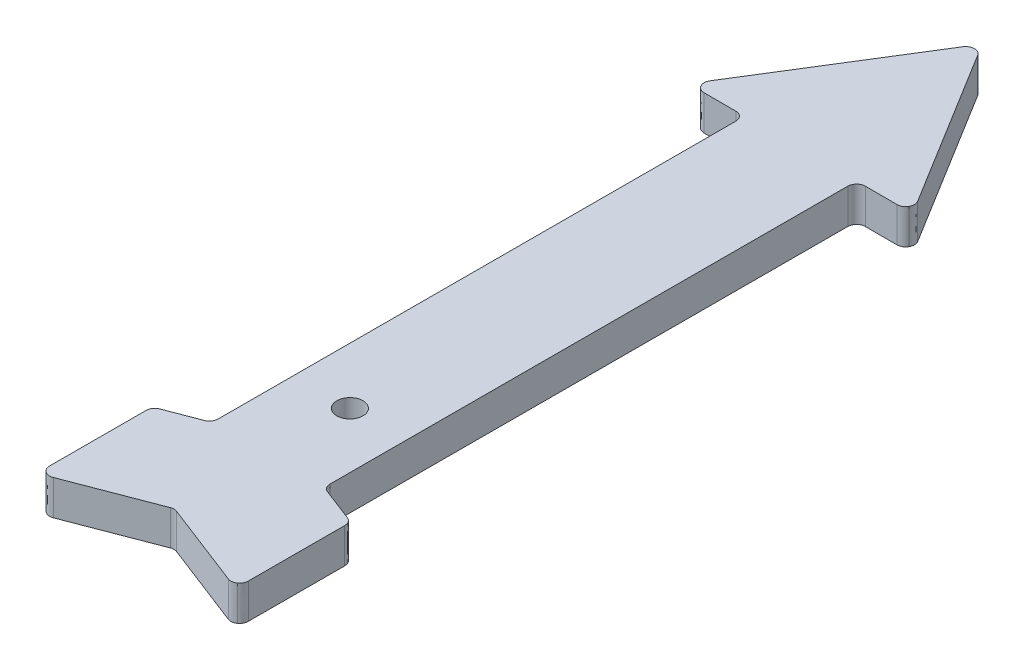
ISO-10303-21;
HEADER;
FILE_DESCRIPTION(('STEP AP214'),'2;1');
FILE_NAME('part.step','',(''),(''),'','','');
FILE_SCHEMA(('AUTOMOTIVE_DESIGN { 1 0 10303 214 1 1 1 1 }'));
ENDSEC;
DATA;
#1=APPLICATION_CONTEXT('core data for automotive mechanical design processes');
#2=APPLICATION_PROTOCOL_DEFINITION('international standard','automotive_design',2000,#1);
#3=PRODUCT_CONTEXT('',#1,'mechanical');
#4=PRODUCT('Part','Part','',(#3));
#5=PRODUCT_RELATED_PRODUCT_CATEGORY('part','',(#4));
#6=PRODUCT_DEFINITION_FORMATION('','',#4);
#7=PRODUCT_DEFINITION_CONTEXT('part definition',#1,'design');
#8=PRODUCT_DEFINITION('design','',#6,#7);
#9=PRODUCT_DEFINITION_SHAPE('','',#8);
#10=(LENGTH_UNIT() NAMED_UNIT(*) SI_UNIT(.MILLI.,.METRE.));
#11=(NAMED_UNIT(*) PLANE_ANGLE_UNIT() SI_UNIT($,.RADIAN.));
#12=(NAMED_UNIT(*) SI_UNIT($,.STERADIAN.) SOLID_ANGLE_UNIT());
#13=UNCERTAINTY_MEASURE_WITH_UNIT(LENGTH_MEASURE(1.E-05),#10,'distance_accuracy_value','');
#14=(GEOMETRIC_REPRESENTATION_CONTEXT(3) GLOBAL_UNCERTAINTY_ASSIGNED_CONTEXT((#13)) GLOBAL_UNIT_ASSIGNED_CONTEXT((#10,
#11,#12)) REPRESENTATION_CONTEXT('',''));
#15=CARTESIAN_POINT('',(0.,0.,0.));
#16=DIRECTION('',(0.,0.,1.));
#17=DIRECTION('',(1.,0.,0.));
#18=AXIS2_PLACEMENT_3D('',#15,#16,#17);
#19=CARTESIAN_POINT('',(6.5401625,16.,9.1937625));
#20=DIRECTION('',(0.,1.,0.));
#21=DIRECTION('',(0.,0.,1.));
#22=AXIS2_PLACEMENT_3D('',#19,#20,#21);
#23=PLANE('',#22);
#24=CARTESIAN_POINT('',(7.0074,16.,9.5598));
#25=CARTESIAN_POINT('',(6.614,16.,9.4075));
#26=CARTESIAN_POINT('',(6.3678,16.,9.0474));
#27=CARTESIAN_POINT('',(6.3685,16.,8.6256));
#28=B_SPLINE_CURVE_WITH_KNOTS('',3,(#24,#25,#26,#27),.UNSPECIFIED.,.F.,.F.,(4,4),
(0.96551724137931,1.),.UNSPECIFIED.);
#29=CARTESIAN_POINT('',(7.0074,16.,9.5598));
#30=VERTEX_POINT('',#29);
#31=CARTESIAN_POINT('',(6.3685,16.,8.6256));
#32=VERTEX_POINT('',#31);
#33=EDGE_CURVE('E753',#30,#32,#28,.T.);
#34=ORIENTED_EDGE('',*,*,#33,.T.);
#35=DIRECTION('',(0.00182271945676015,0.,-0.999998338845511));
#36=VECTOR('',#35,1.);
#37=CARTESIAN_POINT('',(6.3685,16.,8.6256));
#38=LINE('',#37,#36);
#39=CARTESIAN_POINT('',(6.4763,16.,-50.5167));
#40=VERTEX_POINT('',#39);
#41=EDGE_CURVE('E163',#32,#40,#38,.T.);
#42=ORIENTED_EDGE('',*,*,#41,.T.);
#43=CARTESIAN_POINT('',(6.4763,16.,-50.5167));
#44=CARTESIAN_POINT('',(6.4773,16.,-51.0675));
#45=CARTESIAN_POINT('',(6.9273,16.,-51.5159));
#46=CARTESIAN_POINT('',(7.4781,16.,-51.5149));
#47=B_SPLINE_CURVE_WITH_KNOTS('',3,(#43,#44,#45,#46),.UNSPECIFIED.,.F.,.F.,(4,4),
(0.0344827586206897,0.0689655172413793),.UNSPECIFIED.);
#48=CARTESIAN_POINT('',(7.4781,16.,-51.5149));
#49=VERTEX_POINT('',#48);
#50=EDGE_CURVE('E626',#40,#49,#47,.T.);
#51=ORIENTED_EDGE('',*,*,#50,.T.);
#52=DIRECTION('',(0.999998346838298,0.,0.00181832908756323));
#53=VECTOR('',#52,1.);
#54=CARTESIAN_POINT('',(7.4781,16.,-51.5149));
#55=LINE('',#54,#53);
#56=CARTESIAN_POINT('',(11.1078,16.,-51.5083));
#57=VERTEX_POINT('',#56);
#58=EDGE_CURVE('E781',#49,#57,#55,.T.);
#59=ORIENTED_EDGE('',*,*,#58,.T.);
#60=CARTESIAN_POINT('',(11.1078,16.,-51.5083));
#61=CARTESIAN_POINT('',(11.4804,16.,-51.5076));
#62=CARTESIAN_POINT('',(11.8005,16.,-51.6948));
#63=CARTESIAN_POINT('',(11.9823,16.,-52.02));
#64=B_SPLINE_CURVE_WITH_KNOTS('',3,(#60,#61,#62,#63),.UNSPECIFIED.,.F.,.F.,(4,4),
(0.103448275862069,0.137931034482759),.UNSPECIFIED.);
#65=CARTESIAN_POINT('',(11.9823,16.,-52.02));
#66=VERTEX_POINT('',#65);
#67=EDGE_CURVE('E462',#57,#66,#64,.T.);
#68=ORIENTED_EDGE('',*,*,#67,.T.);
#69=CARTESIAN_POINT('',(11.9823,16.,-52.02));
#70=CARTESIAN_POINT('',(12.1642,16.,-52.3451));
#71=CARTESIAN_POINT('',(12.1563,16.,-52.7158));
#72=CARTESIAN_POINT('',(11.9609,16.,-53.033));
#73=B_SPLINE_CURVE_WITH_KNOTS('',3,(#69,#70,#71,#72),.UNSPECIFIED.,.F.,.F.,(4,4),
(0.137931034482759,0.172413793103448),.UNSPECIFIED.);
#74=CARTESIAN_POINT('',(11.9609,16.,-53.033));
#75=VERTEX_POINT('',#74);
#76=EDGE_CURVE('E457',#66,#75,#73,.T.);
#77=ORIENTED_EDGE('',*,*,#76,.T.);
#78=DIRECTION('',(-0.52476613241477,0.,-0.851246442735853));
#79=VECTOR('',#78,1.);
#80=CARTESIAN_POINT('',(11.9609,16.,-53.033));
#81=LINE('',#80,#79);
#82=CARTESIAN_POINT('',(0.9387,16.,-70.9126));
#83=VERTEX_POINT('',#82);
#84=EDGE_CURVE('E461',#75,#83,#81,.T.);
#85=ORIENTED_EDGE('',*,*,#84,.T.);
#86=CARTESIAN_POINT('',(0.9387,16.,-70.9126));
#87=CARTESIAN_POINT('',(0.7517,16.,-71.2161));
#88=CARTESIAN_POINT('',(0.4457,16.,-71.3872));
#89=CARTESIAN_POINT('',(0.0893,16.,-71.3879));
#90=B_SPLINE_CURVE_WITH_KNOTS('',3,(#86,#87,#88,#89),.UNSPECIFIED.,.F.,.F.,(4,4),
(0.206896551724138,0.241379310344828),.UNSPECIFIED.);
#91=CARTESIAN_POINT('',(0.0893,16.,-71.3879));
#92=VERTEX_POINT('',#91);
#93=EDGE_CURVE('E427',#83,#92,#90,.T.);
#94=ORIENTED_EDGE('',*,*,#93,.T.);
#95=CARTESIAN_POINT('',(0.0893,16.,-71.3879));
#96=CARTESIAN_POINT('',(-0.2671,16.,-71.3885));
#97=CARTESIAN_POINT('',(-0.5738,16.,-71.2184));
#98=CARTESIAN_POINT('',(-0.7619,16.,-70.9157));
#99=B_SPLINE_CURVE_WITH_KNOTS('',3,(#95,#96,#97,#98),.UNSPECIFIED.,.F.,.F.,(4,4),
(0.241379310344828,0.275862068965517),.UNSPECIFIED.);
#100=CARTESIAN_POINT('',(-0.7619,16.,-70.9157));
#101=VERTEX_POINT('',#100);
#102=EDGE_CURVE('E422',#92,#101,#99,.T.);
#103=ORIENTED_EDGE('',*,*,#102,.T.);
#104=DIRECTION('',(-0.52785875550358,0.,0.849332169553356));
#105=VECTOR('',#104,1.);
#106=CARTESIAN_POINT('',(-0.7619,16.,-70.9157));
#107=LINE('',#106,#105);
#108=CARTESIAN_POINT('',(-11.849,16.,-53.0764));
#109=VERTEX_POINT('',#108);
#110=EDGE_CURVE('E417',#101,#109,#107,.T.);
#111=ORIENTED_EDGE('',*,*,#110,.T.);
#112=CARTESIAN_POINT('',(-11.849,16.,-53.0764));
#113=CARTESIAN_POINT('',(-12.0456,16.,-52.76));
#114=CARTESIAN_POINT('',(-12.0548,16.,-52.3892));
#115=CARTESIAN_POINT('',(-11.8741,16.,-52.0635));
#116=B_SPLINE_CURVE_WITH_KNOTS('',3,(#112,#113,#114,#115),.UNSPECIFIED.,.F.,.F.,(4,4),
(0.310344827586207,0.344827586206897),.UNSPECIFIED.);
#117=CARTESIAN_POINT('',(-11.8741,16.,-52.0635));
#118=VERTEX_POINT('',#117);
#119=EDGE_CURVE('E409',#109,#118,#116,.T.);
#120=ORIENTED_EDGE('',*,*,#119,.T.);
#121=CARTESIAN_POINT('',(-11.8741,16.,-52.0635));
#122=CARTESIAN_POINT('',(-11.6934,16.,-51.7377));
#123=CARTESIAN_POINT('',(-11.3741,16.,-51.5492));
#124=CARTESIAN_POINT('',(-11.0016,16.,-51.5486));
#125=B_SPLINE_CURVE_WITH_KNOTS('',3,(#121,#122,#123,#124),.UNSPECIFIED.,.F.,.F.,(4,4),
(0.344827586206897,0.379310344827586),.UNSPECIFIED.);
#126=CARTESIAN_POINT('',(-11.0016,16.,-51.5486));
#127=VERTEX_POINT('',#126);
#128=EDGE_CURVE('E405',#118,#127,#125,.T.);
#129=ORIENTED_EDGE('',*,*,#128,.T.);
#130=DIRECTION('',(0.999998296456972,0.,0.00184582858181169));
#131=VECTOR('',#130,1.);
#132=CARTESIAN_POINT('',(-11.0016,16.,-51.5486));
#133=LINE('',#132,#131);
#134=CARTESIAN_POINT('',(-7.3718,16.,-51.5419));
#135=VERTEX_POINT('',#134);
#136=EDGE_CURVE('E385',#127,#135,#133,.T.);
#137=ORIENTED_EDGE('',*,*,#136,.T.);
#138=CARTESIAN_POINT('',(-7.3718,16.,-51.5419));
#139=CARTESIAN_POINT('',(-6.821,16.,-51.5409));
#140=CARTESIAN_POINT('',(-6.3726,16.,-51.0908));
#141=CARTESIAN_POINT('',(-6.3736,16.,-50.5401));
#142=B_SPLINE_CURVE_WITH_KNOTS('',3,(#138,#139,#140,#141),.UNSPECIFIED.,.F.,.F.,(4,4),
(0.413793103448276,0.448275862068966),.UNSPECIFIED.);
#143=CARTESIAN_POINT('',(-6.3736,16.,-50.5401));
#144=VERTEX_POINT('',#143);
#145=EDGE_CURVE('E380',#135,#144,#142,.T.);
#146=ORIENTED_EDGE('',*,*,#145,.T.);
#147=DIRECTION('',(-0.00182272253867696,0.,0.999998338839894));
#148=VECTOR('',#147,1.);
#149=CARTESIAN_POINT('',(-6.3736,16.,-50.5401));
#150=LINE('',#149,#148);
#151=CARTESIAN_POINT('',(-6.4814,16.,8.6021));
#152=VERTEX_POINT('',#151);
#153=EDGE_CURVE('E375',#144,#152,#150,.T.);
#154=ORIENTED_EDGE('',*,*,#153,.T.);
#155=CARTESIAN_POINT('',(-6.4814,16.,8.6021));
#156=CARTESIAN_POINT('',(-6.4822,16.,9.0239));
#157=CARTESIAN_POINT('',(-6.7297,16.,9.3832));
#158=CARTESIAN_POINT('',(-7.1237,16.,9.5341));
#159=B_SPLINE_CURVE_WITH_KNOTS('',3,(#155,#156,#157,#158),.UNSPECIFIED.,.F.,.F.,(4,4),
(0.482758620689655,0.517241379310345),.UNSPECIFIED.);
#160=CARTESIAN_POINT('',(-7.1237,16.,9.5341));
#161=VERTEX_POINT('',#160);
#162=EDGE_CURVE('E370',#152,#161,#159,.T.);
#163=ORIENTED_EDGE('',*,*,#162,.T.);
#164=DIRECTION('',(-0.933822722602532,0.,0.35773610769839));
#165=VECTOR('',#164,1.);
#166=CARTESIAN_POINT('',(-7.1237,16.,9.5341));
#167=LINE('',#166,#165);
#168=CARTESIAN_POINT('',(-10.8098,16.,10.9462));
#169=VERTEX_POINT('',#168);
#170=EDGE_CURVE('E349',#161,#169,#167,.T.);
#171=ORIENTED_EDGE('',*,*,#170,.T.);
#172=CARTESIAN_POINT('',(-10.8098,16.,10.9462));
#173=CARTESIAN_POINT('',(-11.2038,16.,11.0971));
#174=CARTESIAN_POINT('',(-11.4514,16.,11.4563));
#175=CARTESIAN_POINT('',(-11.4521,16.,11.8782));
#176=B_SPLINE_CURVE_WITH_KNOTS('',3,(#172,#173,#174,#175),.UNSPECIFIED.,.F.,.F.,(4,4),
(0.551724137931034,0.586206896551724),.UNSPECIFIED.);
#177=CARTESIAN_POINT('',(-11.4521,16.,11.8782));
#178=VERTEX_POINT('',#177);
#179=EDGE_CURVE('E344',#169,#178,#176,.T.);
#180=ORIENTED_EDGE('',*,*,#179,.T.);
#181=DIRECTION('',(-0.00182445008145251,0.,0.999998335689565));
#182=VECTOR('',#181,1.);
#183=CARTESIAN_POINT('',(-11.4521,16.,11.8782));
#184=LINE('',#183,#182);
#185=CARTESIAN_POINT('',(-11.4722,16.,22.8952));
#186=VERTEX_POINT('',#185);
#187=EDGE_CURVE('E339',#178,#186,#184,.T.);
#188=ORIENTED_EDGE('',*,*,#187,.T.);
#189=CARTESIAN_POINT('',(-11.4722,16.,22.8952));
#190=CARTESIAN_POINT('',(-11.4728,16.,23.235));
#191=CARTESIAN_POINT('',(-11.3195,16.,23.5276));
#192=CARTESIAN_POINT('',(-11.0397,16.,23.7205));
#193=B_SPLINE_CURVE_WITH_KNOTS('',3,(#189,#190,#191,#192),.UNSPECIFIED.,.F.,.F.,(4,4),
(0.620689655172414,0.655172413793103),.UNSPECIFIED.);
#194=CARTESIAN_POINT('',(-11.0397,16.,23.7205));
#195=VERTEX_POINT('',#194);
#196=EDGE_CURVE('E331',#186,#195,#193,.T.);
#197=ORIENTED_EDGE('',*,*,#196,.T.);
#198=CARTESIAN_POINT('',(-11.0397,16.,23.7205));
#199=CARTESIAN_POINT('',(-10.7598,16.,23.9133));
#200=CARTESIAN_POINT('',(-10.4318,16.,23.9524));
#201=CARTESIAN_POINT('',(-10.1145,16.,23.8309));
#202=B_SPLINE_CURVE_WITH_KNOTS('',3,(#198,#199,#200,#201),.UNSPECIFIED.,.F.,.F.,(4,4),
(0.655172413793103,0.689655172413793),.UNSPECIFIED.);
#203=CARTESIAN_POINT('',(-10.1145,16.,23.8309));
#204=VERTEX_POINT('',#203);
#205=EDGE_CURVE('E327',#195,#204,#202,.T.);
#206=ORIENTED_EDGE('',*,*,#205,.T.);
#207=DIRECTION('',(0.933828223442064,0.,-0.357721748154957));
#208=VECTOR('',#207,1.);
#209=CARTESIAN_POINT('',(-10.1145,16.,23.8309));
#210=LINE('',#209,#208);
#211=CARTESIAN_POINT('',(-0.4369,16.,20.1237));
#212=VERTEX_POINT('',#211);
#213=EDGE_CURVE('E305',#204,#212,#210,.T.);
#214=ORIENTED_EDGE('',*,*,#213,.T.);
#215=CARTESIAN_POINT('',(-0.4369,16.,20.1237));
#216=CARTESIAN_POINT('',(-0.1961,16.,20.0315));
#217=CARTESIAN_POINT('',(0.0415,16.,20.0319));
#218=CARTESIAN_POINT('',(0.2819,16.,20.125));
#219=B_SPLINE_CURVE_WITH_KNOTS('',3,(#215,#216,#217,#218),.UNSPECIFIED.,.F.,.F.,(4,4),
(0.724137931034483,0.758620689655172),.UNSPECIFIED.);
#220=CARTESIAN_POINT('',(0.2819,16.,20.125));
#221=VERTEX_POINT('',#220);
#222=EDGE_CURVE('E300',#212,#221,#219,.T.);
#223=ORIENTED_EDGE('',*,*,#222,.T.);
#224=DIRECTION('',(0.932520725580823,0.,0.361116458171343));
#225=VECTOR('',#224,1.);
#226=CARTESIAN_POINT('',(0.2819,16.,20.125));
#227=LINE('',#226,#225);
#228=CARTESIAN_POINT('',(9.946,16.,23.8674));
#229=VERTEX_POINT('',#228);
#230=EDGE_CURVE('E295',#221,#229,#227,.T.);
#231=ORIENTED_EDGE('',*,*,#230,.T.);
#232=CARTESIAN_POINT('',(9.946,16.,23.8674));
#233=CARTESIAN_POINT('',(10.2629,16.,23.9901));
#234=CARTESIAN_POINT('',(10.5911,16.,23.9522));
#235=CARTESIAN_POINT('',(10.8716,16.,23.7604));
#236=B_SPLINE_CURVE_WITH_KNOTS('',3,(#232,#233,#234,#235),.UNSPECIFIED.,.F.,.F.,(4,4),
(0.793103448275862,0.827586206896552),.UNSPECIFIED.);
#237=CARTESIAN_POINT('',(10.8716,16.,23.7604));
#238=VERTEX_POINT('',#237);
#239=EDGE_CURVE('E287',#229,#238,#236,.T.);
#240=ORIENTED_EDGE('',*,*,#239,.T.);
#241=CARTESIAN_POINT('',(10.8716,16.,23.7604));
#242=CARTESIAN_POINT('',(11.1521,16.,23.5685));
#243=CARTESIAN_POINT('',(11.3065,16.,23.2765));
#244=CARTESIAN_POINT('',(11.3071,16.,22.9367));
#245=B_SPLINE_CURVE_WITH_KNOTS('',3,(#241,#242,#243,#244),.UNSPECIFIED.,.F.,.F.,(4,4),
(0.827586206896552,0.862068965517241),.UNSPECIFIED.);
#246=CARTESIAN_POINT('',(11.3071,16.,22.9367));
#247=VERTEX_POINT('',#246);
#248=EDGE_CURVE('E245',#238,#247,#245,.T.);
#249=ORIENTED_EDGE('',*,*,#248,.T.);
#250=DIRECTION('',(0.0018244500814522,0.,-0.999998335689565));
#251=VECTOR('',#250,1.);
#252=CARTESIAN_POINT('',(11.3071,16.,22.9367));
#253=LINE('',#252,#251);
#254=CARTESIAN_POINT('',(11.3272,16.,11.9197));
#255=VERTEX_POINT('',#254);
#256=EDGE_CURVE('E239',#247,#255,#253,.T.);
#257=ORIENTED_EDGE('',*,*,#256,.T.);
#258=CARTESIAN_POINT('',(11.3272,16.,11.9197));
#259=CARTESIAN_POINT('',(11.328,16.,11.4979));
#260=CARTESIAN_POINT('',(11.0818,16.,11.1377));
#261=CARTESIAN_POINT('',(10.6883,16.,10.9854));
#262=B_SPLINE_CURVE_WITH_KNOTS('',3,(#258,#259,#260,#261),.UNSPECIFIED.,.F.,.F.,(4,4),
(0.896551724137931,0.931034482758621),.UNSPECIFIED.);
#263=CARTESIAN_POINT('',(10.6883,16.,10.9854));
#264=VERTEX_POINT('',#263);
#265=EDGE_CURVE('E243',#255,#264,#262,.T.);
#266=ORIENTED_EDGE('',*,*,#265,.T.);
#267=DIRECTION('',(-0.932505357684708,0.,-0.361156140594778));
#268=VECTOR('',#267,1.);
#269=CARTESIAN_POINT('',(10.6883,16.,10.9854));
#270=LINE('',#269,#268);
#271=EDGE_CURVE('E57',#264,#30,#270,.T.);
#272=ORIENTED_EDGE('',*,*,#271,.T.);
#273=EDGE_LOOP('',(#34,#42,#51,#59,#68,#77,#85,#94,#103,#111,#120,#129,#137,#146,#154,#163,#171,
#180,#188,#197,#206,#214,#223,#231,#240,#249,#257,#266,#272));
#274=FACE_BOUND('',#273,.T.);
#275=CARTESIAN_POINT('',(0.,16.,0.));
#276=DIRECTION('',(0.,1.,0.));
#277=DIRECTION('',(0.,0.,1.));
#278=AXIS2_PLACEMENT_3D('',#275,#276,#277);
#279=CIRCLE('',#278,1.5);
#280=CARTESIAN_POINT('',(0.,16.,1.5));
#281=VERTEX_POINT('',#280);
#282=EDGE_CURVE('E757',#281,#281,#279,.T.);
#283=ORIENTED_EDGE('',*,*,#282,.F.);
#284=EDGE_LOOP('',(#283));
#285=FACE_BOUND('',#284,.T.);
#286=ADVANCED_FACE('F39',(#274,#285),#23,.T.);
#287=CARTESIAN_POINT('',(6.5401625,12.,9.1937625));
#288=DIRECTION('',(0.,1.,0.));
#289=DIRECTION('',(0.,0.,1.));
#290=AXIS2_PLACEMENT_3D('',#287,#288,#289);
#291=PLANE('',#290);
#292=CARTESIAN_POINT('',(7.0074,12.,9.5598));
#293=CARTESIAN_POINT('',(6.614,12.,9.4075));
#294=CARTESIAN_POINT('',(6.3678,12.,9.0474));
#295=CARTESIAN_POINT('',(6.3685,12.,8.6256));
#296=B_SPLINE_CURVE_WITH_KNOTS('',3,(#292,#293,#294,#295),.UNSPECIFIED.,.F.,.F.,(4,4),
(0.96551724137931,1.),.UNSPECIFIED.);
#297=CARTESIAN_POINT('',(7.0074,12.,9.5598));
#298=VERTEX_POINT('',#297);
#299=CARTESIAN_POINT('',(6.3685,12.,8.6256));
#300=VERTEX_POINT('',#299);
#301=EDGE_CURVE('E638',#298,#300,#296,.T.);
#302=ORIENTED_EDGE('',*,*,#301,.F.);
#303=DIRECTION('',(-0.932505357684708,0.,-0.361156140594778));
#304=VECTOR('',#303,1.);
#305=CARTESIAN_POINT('',(10.6883,12.,10.9854));
#306=LINE('',#305,#304);
#307=CARTESIAN_POINT('',(10.6883,12.,10.9854));
#308=VERTEX_POINT('',#307);
#309=EDGE_CURVE('E155',#308,#298,#306,.T.);
#310=ORIENTED_EDGE('',*,*,#309,.F.);
#311=CARTESIAN_POINT('',(11.3272,12.,11.9197));
#312=CARTESIAN_POINT('',(11.328,12.,11.4979));
#313=CARTESIAN_POINT('',(11.0818,12.,11.1377));
#314=CARTESIAN_POINT('',(10.6883,12.,10.9854));
#315=B_SPLINE_CURVE_WITH_KNOTS('',3,(#311,#312,#313,#314),.UNSPECIFIED.,.F.,.F.,(4,4),
(0.896551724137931,0.931034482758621),.UNSPECIFIED.);
#316=CARTESIAN_POINT('',(11.3272,12.,11.9197));
#317=VERTEX_POINT('',#316);
#318=EDGE_CURVE('E149',#317,#308,#315,.T.);
#319=ORIENTED_EDGE('',*,*,#318,.F.);
#320=DIRECTION('',(0.0018244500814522,0.,-0.999998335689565));
#321=VECTOR('',#320,1.);
#322=CARTESIAN_POINT('',(11.3071,12.,22.9367));
#323=LINE('',#322,#321);
#324=CARTESIAN_POINT('',(11.3071,12.,22.9367));
#325=VERTEX_POINT('',#324);
#326=EDGE_CURVE('E253',#325,#317,#323,.T.);
#327=ORIENTED_EDGE('',*,*,#326,.F.);
#328=CARTESIAN_POINT('',(10.8716,12.,23.7604));
#329=CARTESIAN_POINT('',(11.1521,12.,23.5685));
#330=CARTESIAN_POINT('',(11.3065,12.,23.2765));
#331=CARTESIAN_POINT('',(11.3071,12.,22.9367));
#332=B_SPLINE_CURVE_WITH_KNOTS('',3,(#328,#329,#330,#331),.UNSPECIFIED.,.F.,.F.,(4,4),
(0.827586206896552,0.862068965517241),.UNSPECIFIED.);
#333=CARTESIAN_POINT('',(10.8716,12.,23.7604));
#334=VERTEX_POINT('',#333);
#335=EDGE_CURVE('E598',#334,#325,#332,.T.);
#336=ORIENTED_EDGE('',*,*,#335,.F.);
#337=CARTESIAN_POINT('',(9.946,12.,23.8674));
#338=CARTESIAN_POINT('',(10.2629,12.,23.9901));
#339=CARTESIAN_POINT('',(10.5911,12.,23.9522));
#340=CARTESIAN_POINT('',(10.8716,12.,23.7604));
#341=B_SPLINE_CURVE_WITH_KNOTS('',3,(#337,#338,#339,#340),.UNSPECIFIED.,.F.,.F.,(4,4),
(0.793103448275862,0.827586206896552),.UNSPECIFIED.);
#342=CARTESIAN_POINT('',(9.946,12.,23.8674));
#343=VERTEX_POINT('',#342);
#344=EDGE_CURVE('E595',#343,#334,#341,.T.);
#345=ORIENTED_EDGE('',*,*,#344,.F.);
#346=DIRECTION('',(0.932520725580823,0.,0.361116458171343));
#347=VECTOR('',#346,1.);
#348=CARTESIAN_POINT('',(0.2819,12.,20.125));
#349=LINE('',#348,#347);
#350=CARTESIAN_POINT('',(0.2819,12.,20.125));
#351=VERTEX_POINT('',#350);
#352=EDGE_CURVE('E588',#351,#343,#349,.T.);
#353=ORIENTED_EDGE('',*,*,#352,.F.);
#354=CARTESIAN_POINT('',(-0.4369,12.,20.1237));
#355=CARTESIAN_POINT('',(-0.1961,12.,20.0315));
#356=CARTESIAN_POINT('',(0.0415,12.,20.0319));
#357=CARTESIAN_POINT('',(0.2819,12.,20.125));
#358=B_SPLINE_CURVE_WITH_KNOTS('',3,(#354,#355,#356,#357),.UNSPECIFIED.,.F.,.F.,(4,4),
(0.724137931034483,0.758620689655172),.UNSPECIFIED.);
#359=CARTESIAN_POINT('',(-0.4369,12.,20.1237));
#360=VERTEX_POINT('',#359);
#361=EDGE_CURVE('E581',#360,#351,#358,.T.);
#362=ORIENTED_EDGE('',*,*,#361,.F.);
#363=DIRECTION('',(0.933828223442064,0.,-0.357721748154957));
#364=VECTOR('',#363,1.);
#365=CARTESIAN_POINT('',(-10.1145,12.,23.8309));
#366=LINE('',#365,#364);
#367=CARTESIAN_POINT('',(-10.1145,12.,23.8309));
#368=VERTEX_POINT('',#367);
#369=EDGE_CURVE('E721',#368,#360,#366,.T.);
#370=ORIENTED_EDGE('',*,*,#369,.F.);
#371=CARTESIAN_POINT('',(-11.0397,12.,23.7205));
#372=CARTESIAN_POINT('',(-10.7598,12.,23.9133));
#373=CARTESIAN_POINT('',(-10.4318,12.,23.9524));
#374=CARTESIAN_POINT('',(-10.1145,12.,23.8309));
#375=B_SPLINE_CURVE_WITH_KNOTS('',3,(#371,#372,#373,#374),.UNSPECIFIED.,.F.,.F.,(4,4),
(0.655172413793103,0.689655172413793),.UNSPECIFIED.);
#376=CARTESIAN_POINT('',(-11.0397,12.,23.7205));
#377=VERTEX_POINT('',#376);
#378=EDGE_CURVE('E568',#377,#368,#375,.T.);
#379=ORIENTED_EDGE('',*,*,#378,.F.);
#380=CARTESIAN_POINT('',(-11.4722,12.,22.8952));
#381=CARTESIAN_POINT('',(-11.4728,12.,23.235));
#382=CARTESIAN_POINT('',(-11.3195,12.,23.5276));
#383=CARTESIAN_POINT('',(-11.0397,12.,23.7205));
#384=B_SPLINE_CURVE_WITH_KNOTS('',3,(#380,#381,#382,#383),.UNSPECIFIED.,.F.,.F.,(4,4),
(0.620689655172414,0.655172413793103),.UNSPECIFIED.);
#385=CARTESIAN_POINT('',(-11.4722,12.,22.8952));
#386=VERTEX_POINT('',#385);
#387=EDGE_CURVE('E562',#386,#377,#384,.T.);
#388=ORIENTED_EDGE('',*,*,#387,.F.);
#389=DIRECTION('',(-0.00182445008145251,0.,0.999998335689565));
#390=VECTOR('',#389,1.);
#391=CARTESIAN_POINT('',(-11.4521,12.,11.8782));
#392=LINE('',#391,#390);
#393=CARTESIAN_POINT('',(-11.4521,12.,11.8782));
#394=VERTEX_POINT('',#393);
#395=EDGE_CURVE('E707',#394,#386,#392,.T.);
#396=ORIENTED_EDGE('',*,*,#395,.F.);
#397=CARTESIAN_POINT('',(-10.8098,12.,10.9462));
#398=CARTESIAN_POINT('',(-11.2038,12.,11.0971));
#399=CARTESIAN_POINT('',(-11.4514,12.,11.4563));
#400=CARTESIAN_POINT('',(-11.4521,12.,11.8782));
#401=B_SPLINE_CURVE_WITH_KNOTS('',3,(#397,#398,#399,#400),.UNSPECIFIED.,.F.,.F.,(4,4),
(0.551724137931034,0.586206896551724),.UNSPECIFIED.);
#402=CARTESIAN_POINT('',(-10.8098,12.,10.9462));
#403=VERTEX_POINT('',#402);
#404=EDGE_CURVE('E547',#403,#394,#401,.T.);
#405=ORIENTED_EDGE('',*,*,#404,.F.);
#406=DIRECTION('',(-0.933822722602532,0.,0.35773610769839));
#407=VECTOR('',#406,1.);
#408=CARTESIAN_POINT('',(-7.1237,12.,9.5341));
#409=LINE('',#408,#407);
#410=CARTESIAN_POINT('',(-7.1237,12.,9.5341));
#411=VERTEX_POINT('',#410);
#412=EDGE_CURVE('E541',#411,#403,#409,.T.);
#413=ORIENTED_EDGE('',*,*,#412,.F.);
#414=CARTESIAN_POINT('',(-6.4814,12.,8.6021));
#415=CARTESIAN_POINT('',(-6.4822,12.,9.0239));
#416=CARTESIAN_POINT('',(-6.7297,12.,9.3832));
#417=CARTESIAN_POINT('',(-7.1237,12.,9.5341));
#418=B_SPLINE_CURVE_WITH_KNOTS('',3,(#414,#415,#416,#417),.UNSPECIFIED.,.F.,.F.,(4,4),
(0.482758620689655,0.517241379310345),.UNSPECIFIED.);
#419=CARTESIAN_POINT('',(-6.4814,12.,8.6021));
#420=VERTEX_POINT('',#419);
#421=EDGE_CURVE('E696',#420,#411,#418,.T.);
#422=ORIENTED_EDGE('',*,*,#421,.F.);
#423=DIRECTION('',(-0.00182272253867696,0.,0.999998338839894));
#424=VECTOR('',#423,1.);
#425=CARTESIAN_POINT('',(-6.3736,12.,-50.5401));
#426=LINE('',#425,#424);
#427=CARTESIAN_POINT('',(-6.3736,12.,-50.5401));
#428=VERTEX_POINT('',#427);
#429=EDGE_CURVE('E528',#428,#420,#426,.T.);
#430=ORIENTED_EDGE('',*,*,#429,.F.);
#431=CARTESIAN_POINT('',(-7.3718,12.,-51.5419));
#432=CARTESIAN_POINT('',(-6.821,12.,-51.5409));
#433=CARTESIAN_POINT('',(-6.3726,12.,-51.0908));
#434=CARTESIAN_POINT('',(-6.3736,12.,-50.5401));
#435=B_SPLINE_CURVE_WITH_KNOTS('',3,(#431,#432,#433,#434),.UNSPECIFIED.,.F.,.F.,(4,4),
(0.413793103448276,0.448275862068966),.UNSPECIFIED.);
#436=CARTESIAN_POINT('',(-7.3718,12.,-51.5419));
#437=VERTEX_POINT('',#436);
#438=EDGE_CURVE('E521',#437,#428,#435,.T.);
#439=ORIENTED_EDGE('',*,*,#438,.F.);
#440=DIRECTION('',(0.999998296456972,0.,0.00184582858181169));
#441=VECTOR('',#440,1.);
#442=CARTESIAN_POINT('',(-11.0016,12.,-51.5486));
#443=LINE('',#442,#441);
#444=CARTESIAN_POINT('',(-11.0016,12.,-51.5486));
#445=VERTEX_POINT('',#444);
#446=EDGE_CURVE('E684',#445,#437,#443,.T.);
#447=ORIENTED_EDGE('',*,*,#446,.F.);
#448=CARTESIAN_POINT('',(-11.8741,12.,-52.0635));
#449=CARTESIAN_POINT('',(-11.6934,12.,-51.7377));
#450=CARTESIAN_POINT('',(-11.3741,12.,-51.5492));
#451=CARTESIAN_POINT('',(-11.0016,12.,-51.5486));
#452=B_SPLINE_CURVE_WITH_KNOTS('',3,(#448,#449,#450,#451),.UNSPECIFIED.,.F.,.F.,(4,4),
(0.344827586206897,0.379310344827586),.UNSPECIFIED.);
#453=CARTESIAN_POINT('',(-11.8741,12.,-52.0635));
#454=VERTEX_POINT('',#453);
#455=EDGE_CURVE('E508',#454,#445,#452,.T.);
#456=ORIENTED_EDGE('',*,*,#455,.F.);
#457=CARTESIAN_POINT('',(-11.849,12.,-53.0764));
#458=CARTESIAN_POINT('',(-12.0456,12.,-52.76));
#459=CARTESIAN_POINT('',(-12.0548,12.,-52.3892));
#460=CARTESIAN_POINT('',(-11.8741,12.,-52.0635));
#461=B_SPLINE_CURVE_WITH_KNOTS('',3,(#457,#458,#459,#460),.UNSPECIFIED.,.F.,.F.,(4,4),
(0.310344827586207,0.344827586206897),.UNSPECIFIED.);
#462=CARTESIAN_POINT('',(-11.849,12.,-53.0764));
#463=VERTEX_POINT('',#462);
#464=EDGE_CURVE('E502',#463,#454,#461,.T.);
#465=ORIENTED_EDGE('',*,*,#464,.F.);
#466=DIRECTION('',(-0.52785875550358,0.,0.849332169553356));
#467=VECTOR('',#466,1.);
#468=CARTESIAN_POINT('',(-0.7619,12.,-70.9157));
#469=LINE('',#468,#467);
#470=CARTESIAN_POINT('',(-0.7619,12.,-70.9157));
#471=VERTEX_POINT('',#470);
#472=EDGE_CURVE('E670',#471,#463,#469,.T.);
#473=ORIENTED_EDGE('',*,*,#472,.F.);
#474=CARTESIAN_POINT('',(0.0893,12.,-71.3879));
#475=CARTESIAN_POINT('',(-0.2671,12.,-71.3885));
#476=CARTESIAN_POINT('',(-0.5738,12.,-71.2184));
#477=CARTESIAN_POINT('',(-0.7619,12.,-70.9157));
#478=B_SPLINE_CURVE_WITH_KNOTS('',3,(#474,#475,#476,#477),.UNSPECIFIED.,.F.,.F.,(4,4),
(0.241379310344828,0.275862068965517),.UNSPECIFIED.);
#479=CARTESIAN_POINT('',(0.0893,12.,-71.3879));
#480=VERTEX_POINT('',#479);
#481=EDGE_CURVE('E487',#480,#471,#478,.T.);
#482=ORIENTED_EDGE('',*,*,#481,.F.);
#483=CARTESIAN_POINT('',(0.9387,12.,-70.9126));
#484=CARTESIAN_POINT('',(0.7517,12.,-71.2161));
#485=CARTESIAN_POINT('',(0.4457,12.,-71.3872));
#486=CARTESIAN_POINT('',(0.0893,12.,-71.3879));
#487=B_SPLINE_CURVE_WITH_KNOTS('',3,(#483,#484,#485,#486),.UNSPECIFIED.,.F.,.F.,(4,4),
(0.206896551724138,0.241379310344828),.UNSPECIFIED.);
#488=CARTESIAN_POINT('',(0.9387,12.,-70.9126));
#489=VERTEX_POINT('',#488);
#490=EDGE_CURVE('E480',#489,#480,#487,.T.);
#491=ORIENTED_EDGE('',*,*,#490,.F.);
#492=DIRECTION('',(-0.52476613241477,0.,-0.851246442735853));
#493=VECTOR('',#492,1.);
#494=CARTESIAN_POINT('',(11.9609,12.,-53.033));
#495=LINE('',#494,#493);
#496=CARTESIAN_POINT('',(11.9609,12.,-53.033));
#497=VERTEX_POINT('',#496);
#498=EDGE_CURVE('E656',#497,#489,#495,.T.);
#499=ORIENTED_EDGE('',*,*,#498,.F.);
#500=CARTESIAN_POINT('',(11.9823,12.,-52.02));
#501=CARTESIAN_POINT('',(12.1642,12.,-52.3451));
#502=CARTESIAN_POINT('',(12.1563,12.,-52.7158));
#503=CARTESIAN_POINT('',(11.9609,12.,-53.033));
#504=B_SPLINE_CURVE_WITH_KNOTS('',3,(#500,#501,#502,#503),.UNSPECIFIED.,.F.,.F.,(4,4),
(0.137931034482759,0.172413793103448),.UNSPECIFIED.);
#505=CARTESIAN_POINT('',(11.9823,12.,-52.02));
#506=VERTEX_POINT('',#505);
#507=EDGE_CURVE('E649',#506,#497,#504,.T.);
#508=ORIENTED_EDGE('',*,*,#507,.F.);
#509=CARTESIAN_POINT('',(11.1078,12.,-51.5083));
#510=CARTESIAN_POINT('',(11.4804,12.,-51.5076));
#511=CARTESIAN_POINT('',(11.8005,12.,-51.6948));
#512=CARTESIAN_POINT('',(11.9823,12.,-52.02));
#513=B_SPLINE_CURVE_WITH_KNOTS('',3,(#509,#510,#511,#512),.UNSPECIFIED.,.F.,.F.,(4,4),
(0.103448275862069,0.137931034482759),.UNSPECIFIED.);
#514=CARTESIAN_POINT('',(11.1078,12.,-51.5083));
#515=VERTEX_POINT('',#514);
#516=EDGE_CURVE('E636',#515,#506,#513,.T.);
#517=ORIENTED_EDGE('',*,*,#516,.F.);
#518=DIRECTION('',(0.999998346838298,0.,0.00181832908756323));
#519=VECTOR('',#518,1.);
#520=CARTESIAN_POINT('',(7.4781,12.,-51.5149));
#521=LINE('',#520,#519);
#522=CARTESIAN_POINT('',(7.4781,12.,-51.5149));
#523=VERTEX_POINT('',#522);
#524=EDGE_CURVE('E634',#523,#515,#521,.T.);
#525=ORIENTED_EDGE('',*,*,#524,.F.);
#526=CARTESIAN_POINT('',(6.4763,12.,-50.5167));
#527=CARTESIAN_POINT('',(6.4773,12.,-51.0675));
#528=CARTESIAN_POINT('',(6.9273,12.,-51.5159));
#529=CARTESIAN_POINT('',(7.4781,12.,-51.5149));
#530=B_SPLINE_CURVE_WITH_KNOTS('',3,(#526,#527,#528,#529),.UNSPECIFIED.,.F.,.F.,(4,4),
(0.0344827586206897,0.0689655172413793),.UNSPECIFIED.);
#531=CARTESIAN_POINT('',(6.4763,12.,-50.5167));
#532=VERTEX_POINT('',#531);
#533=EDGE_CURVE('E625',#532,#523,#530,.T.);
#534=ORIENTED_EDGE('',*,*,#533,.F.);
#535=DIRECTION('',(0.00182271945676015,0.,-0.999998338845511));
#536=VECTOR('',#535,1.);
#537=CARTESIAN_POINT('',(6.3685,12.,8.6256));
#538=LINE('',#537,#536);
#539=EDGE_CURVE('E632',#300,#532,#538,.T.);
#540=ORIENTED_EDGE('',*,*,#539,.F.);
#541=EDGE_LOOP('',(#302,#310,#319,#327,#336,#345,#353,#362,#370,#379,#388,#396,#405,#413,#422,
#430,#439,#447,#456,#465,#473,#482,#491,#499,#508,#517,#525,#534,#540));
#542=FACE_BOUND('',#541,.T.);
#543=CARTESIAN_POINT('',(0.,12.,0.));
#544=DIRECTION('',(0.,1.,0.));
#545=DIRECTION('',(0.,0.,1.));
#546=AXIS2_PLACEMENT_3D('',#543,#544,#545);
#547=CIRCLE('',#546,1.5);
#548=CARTESIAN_POINT('',(0.,12.,1.5));
#549=VERTEX_POINT('',#548);
#550=EDGE_CURVE('E759',#549,#549,#547,.T.);
#551=ORIENTED_EDGE('',*,*,#550,.T.);
#552=EDGE_LOOP('',(#551));
#553=FACE_BOUND('',#552,.T.);
#554=ADVANCED_FACE('F630',(#542,#553),#291,.F.);
#555=DIRECTION('',(0.,-1.,0.));
#556=VECTOR('',#555,1.);
#557=SURFACE_OF_LINEAR_EXTRUSION('',#28,#556);
#558=ORIENTED_EDGE('',*,*,#301,.T.);
#559=DIRECTION('',(0.,-1.,0.));
#560=VECTOR('',#559,1.);
#561=CARTESIAN_POINT('',(6.3685,16.,8.6256));
#562=LINE('',#561,#560);
#563=EDGE_CURVE('E11',#32,#300,#562,.T.);
#564=ORIENTED_EDGE('',*,*,#563,.F.);
#565=ORIENTED_EDGE('',*,*,#33,.F.);
#566=DIRECTION('',(0.,-1.,0.));
#567=VECTOR('',#566,1.);
#568=CARTESIAN_POINT('',(7.0074,16.,9.5598));
#569=LINE('',#568,#567);
#570=EDGE_CURVE('E259',#30,#298,#569,.T.);
#571=ORIENTED_EDGE('',*,*,#570,.T.);
#572=EDGE_LOOP('',(#558,#564,#565,#571));
#573=FACE_BOUND('',#572,.T.);
#574=ADVANCED_FACE('F41',(#573),#557,.F.);
#575=CARTESIAN_POINT('',(6.3685,16.,8.6256));
#576=DIRECTION('',(-0.999998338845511,0.,-0.00182271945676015));
#577=DIRECTION('',(-0.00182271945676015,0.,0.999998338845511));
#578=AXIS2_PLACEMENT_3D('',#575,#576,#577);
#579=PLANE('',#578);
#580=ORIENTED_EDGE('',*,*,#539,.T.);
#581=DIRECTION('',(0.,-1.,0.));
#582=VECTOR('',#581,1.);
#583=CARTESIAN_POINT('',(6.4763,16.,-50.5167));
#584=LINE('',#583,#582);
#585=EDGE_CURVE('E49',#40,#532,#584,.T.);
#586=ORIENTED_EDGE('',*,*,#585,.F.);
#587=ORIENTED_EDGE('',*,*,#41,.F.);
#588=ORIENTED_EDGE('',*,*,#563,.T.);
#589=EDGE_LOOP('',(#580,#586,#587,#588));
#590=FACE_BOUND('',#589,.T.);
#591=ADVANCED_FACE('F788',(#590),#579,.F.);
#592=DIRECTION('',(0.,-1.,0.));
#593=VECTOR('',#592,1.);
#594=SURFACE_OF_LINEAR_EXTRUSION('',#47,#593);
#595=ORIENTED_EDGE('',*,*,#533,.T.);
#596=DIRECTION('',(0.,-1.,0.));
#597=VECTOR('',#596,1.);
#598=CARTESIAN_POINT('',(7.4781,16.,-51.5149));
#599=LINE('',#598,#597);
#600=EDGE_CURVE('E617',#49,#523,#599,.T.);
#601=ORIENTED_EDGE('',*,*,#600,.F.);
#602=ORIENTED_EDGE('',*,*,#50,.F.);
#603=ORIENTED_EDGE('',*,*,#585,.T.);
#604=EDGE_LOOP('',(#595,#601,#602,#603));
#605=FACE_BOUND('',#604,.T.);
#606=ADVANCED_FACE('F623',(#605),#594,.F.);
#607=CARTESIAN_POINT('',(7.4781,16.,-51.5149));
#608=DIRECTION('',(0.00181832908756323,0.,-0.999998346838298));
#609=DIRECTION('',(-0.999998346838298,0.,-0.00181832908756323));
#610=AXIS2_PLACEMENT_3D('',#607,#608,#609);
#611=PLANE('',#610);
#612=ORIENTED_EDGE('',*,*,#524,.T.);
#613=DIRECTION('',(0.,-1.,0.));
#614=VECTOR('',#613,1.);
#615=CARTESIAN_POINT('',(11.1078,16.,-51.5083));
#616=LINE('',#615,#614);
#617=EDGE_CURVE('E614',#57,#515,#616,.T.);
#618=ORIENTED_EDGE('',*,*,#617,.F.);
#619=ORIENTED_EDGE('',*,*,#58,.F.);
#620=ORIENTED_EDGE('',*,*,#600,.T.);
#621=EDGE_LOOP('',(#612,#618,#619,#620));
#622=FACE_BOUND('',#621,.T.);
#623=ADVANCED_FACE('F787',(#622),#611,.F.);
#624=DIRECTION('',(0.,-1.,0.));
#625=VECTOR('',#624,1.);
#626=SURFACE_OF_LINEAR_EXTRUSION('',#64,#625);
#627=ORIENTED_EDGE('',*,*,#516,.T.);
#628=DIRECTION('',(0.,-1.,0.));
#629=VECTOR('',#628,1.);
#630=CARTESIAN_POINT('',(11.9823,16.,-52.02));
#631=LINE('',#630,#629);
#632=EDGE_CURVE('E611',#66,#506,#631,.T.);
#633=ORIENTED_EDGE('',*,*,#632,.F.);
#634=ORIENTED_EDGE('',*,*,#67,.F.);
#635=ORIENTED_EDGE('',*,*,#617,.T.);
#636=EDGE_LOOP('',(#627,#633,#634,#635));
#637=FACE_BOUND('',#636,.T.);
#638=ADVANCED_FACE('F453',(#637),#626,.F.);
#639=DIRECTION('',(0.,-1.,0.));
#640=VECTOR('',#639,1.);
#641=SURFACE_OF_LINEAR_EXTRUSION('',#73,#640);
#642=ORIENTED_EDGE('',*,*,#507,.T.);
#643=DIRECTION('',(0.,-1.,0.));
#644=VECTOR('',#643,1.);
#645=CARTESIAN_POINT('',(11.9609,16.,-53.033));
#646=LINE('',#645,#644);
#647=EDGE_CURVE('E608',#75,#497,#646,.T.);
#648=ORIENTED_EDGE('',*,*,#647,.F.);
#649=ORIENTED_EDGE('',*,*,#76,.F.);
#650=ORIENTED_EDGE('',*,*,#632,.T.);
#651=EDGE_LOOP('',(#642,#648,#649,#650));
#652=FACE_BOUND('',#651,.T.);
#653=ADVANCED_FACE('F448',(#652),#641,.F.);
#654=CARTESIAN_POINT('',(11.9609,16.,-53.033));
#655=DIRECTION('',(-0.851246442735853,0.,0.52476613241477));
#656=DIRECTION('',(0.52476613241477,0.,0.851246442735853));
#657=AXIS2_PLACEMENT_3D('',#654,#655,#656);
#658=PLANE('',#657);
#659=ORIENTED_EDGE('',*,*,#498,.T.);
#660=DIRECTION('',(0.,-1.,0.));
#661=VECTOR('',#660,1.);
#662=CARTESIAN_POINT('',(0.9387,16.,-70.9126));
#663=LINE('',#662,#661);
#664=EDGE_CURVE('E482',#83,#489,#663,.T.);
#665=ORIENTED_EDGE('',*,*,#664,.F.);
#666=ORIENTED_EDGE('',*,*,#84,.F.);
#667=ORIENTED_EDGE('',*,*,#647,.T.);
#668=EDGE_LOOP('',(#659,#665,#666,#667));
#669=FACE_BOUND('',#668,.T.);
#670=ADVANCED_FACE('F444',(#669),#658,.F.);
#671=DIRECTION('',(0.,-1.,0.));
#672=VECTOR('',#671,1.);
#673=SURFACE_OF_LINEAR_EXTRUSION('',#90,#672);
#674=ORIENTED_EDGE('',*,*,#490,.T.);
#675=DIRECTION('',(0.,-1.,0.));
#676=VECTOR('',#675,1.);
#677=CARTESIAN_POINT('',(0.0893,16.,-71.3879));
#678=LINE('',#677,#676);
#679=EDGE_CURVE('E478',#92,#480,#678,.T.);
#680=ORIENTED_EDGE('',*,*,#679,.F.);
#681=ORIENTED_EDGE('',*,*,#93,.F.);
#682=ORIENTED_EDGE('',*,*,#664,.T.);
#683=EDGE_LOOP('',(#674,#680,#681,#682));
#684=FACE_BOUND('',#683,.T.);
#685=ADVANCED_FACE('F440',(#684),#673,.F.);
#686=DIRECTION('',(0.,-1.,0.));
#687=VECTOR('',#686,1.);
#688=SURFACE_OF_LINEAR_EXTRUSION('',#99,#687);
#689=ORIENTED_EDGE('',*,*,#481,.T.);
#690=DIRECTION('',(0.,-1.,0.));
#691=VECTOR('',#690,1.);
#692=CARTESIAN_POINT('',(-0.7619,16.,-70.9157));
#693=LINE('',#692,#691);
#694=EDGE_CURVE('E483',#101,#471,#693,.T.);
#695=ORIENTED_EDGE('',*,*,#694,.F.);
#696=ORIENTED_EDGE('',*,*,#102,.F.);
#697=ORIENTED_EDGE('',*,*,#679,.T.);
#698=EDGE_LOOP('',(#689,#695,#696,#697));
#699=FACE_BOUND('',#698,.T.);
#700=ADVANCED_FACE('F436',(#699),#688,.F.);
#701=CARTESIAN_POINT('',(-0.7619,16.,-70.9157));
#702=DIRECTION('',(0.849332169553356,0.,0.52785875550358));
#703=DIRECTION('',(0.52785875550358,0.,-0.849332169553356));
#704=AXIS2_PLACEMENT_3D('',#701,#702,#703);
#705=PLANE('',#704);
#706=ORIENTED_EDGE('',*,*,#472,.T.);
#707=DIRECTION('',(0.,-1.,0.));
#708=VECTOR('',#707,1.);
#709=CARTESIAN_POINT('',(-11.849,16.,-53.0764));
#710=LINE('',#709,#708);
#711=EDGE_CURVE('E490',#109,#463,#710,.T.);
#712=ORIENTED_EDGE('',*,*,#711,.F.);
#713=ORIENTED_EDGE('',*,*,#110,.F.);
#714=ORIENTED_EDGE('',*,*,#694,.T.);
#715=EDGE_LOOP('',(#706,#712,#713,#714));
#716=FACE_BOUND('',#715,.T.);
#717=ADVANCED_FACE('F439',(#716),#705,.F.);
#718=DIRECTION('',(0.,-1.,0.));
#719=VECTOR('',#718,1.);
#720=SURFACE_OF_LINEAR_EXTRUSION('',#116,#719);
#721=ORIENTED_EDGE('',*,*,#464,.T.);
#722=DIRECTION('',(0.,-1.,0.));
#723=VECTOR('',#722,1.);
#724=CARTESIAN_POINT('',(-11.8741,16.,-52.0635));
#725=LINE('',#724,#723);
#726=EDGE_CURVE('E500',#118,#454,#725,.T.);
#727=ORIENTED_EDGE('',*,*,#726,.F.);
#728=ORIENTED_EDGE('',*,*,#119,.F.);
#729=ORIENTED_EDGE('',*,*,#711,.T.);
#730=EDGE_LOOP('',(#721,#727,#728,#729));
#731=FACE_BOUND('',#730,.T.);
#732=ADVANCED_FACE('F401',(#731),#720,.F.);
#733=DIRECTION('',(0.,-1.,0.));
#734=VECTOR('',#733,1.);
#735=SURFACE_OF_LINEAR_EXTRUSION('',#125,#734);
#736=ORIENTED_EDGE('',*,*,#455,.T.);
#737=DIRECTION('',(0.,-1.,0.));
#738=VECTOR('',#737,1.);
#739=CARTESIAN_POINT('',(-11.0016,16.,-51.5486));
#740=LINE('',#739,#738);
#741=EDGE_CURVE('E504',#127,#445,#740,.T.);
#742=ORIENTED_EDGE('',*,*,#741,.F.);
#743=ORIENTED_EDGE('',*,*,#128,.F.);
#744=ORIENTED_EDGE('',*,*,#726,.T.);
#745=EDGE_LOOP('',(#736,#742,#743,#744));
#746=FACE_BOUND('',#745,.T.);
#747=ADVANCED_FACE('F397',(#746),#735,.F.);
#748=CARTESIAN_POINT('',(-11.0016,16.,-51.5486));
#749=DIRECTION('',(0.00184582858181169,0.,-0.999998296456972));
#750=DIRECTION('',(-0.999998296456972,0.,-0.0018458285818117));
#751=AXIS2_PLACEMENT_3D('',#748,#749,#750);
#752=PLANE('',#751);
#753=ORIENTED_EDGE('',*,*,#446,.T.);
#754=DIRECTION('',(0.,-1.,0.));
#755=VECTOR('',#754,1.);
#756=CARTESIAN_POINT('',(-7.3718,16.,-51.5419));
#757=LINE('',#756,#755);
#758=EDGE_CURVE('E510',#135,#437,#757,.T.);
#759=ORIENTED_EDGE('',*,*,#758,.F.);
#760=ORIENTED_EDGE('',*,*,#136,.F.);
#761=ORIENTED_EDGE('',*,*,#741,.T.);
#762=EDGE_LOOP('',(#753,#759,#760,#761));
#763=FACE_BOUND('',#762,.T.);
#764=ADVANCED_FACE('F393',(#763),#752,.F.);
#765=DIRECTION('',(0.,-1.,0.));
#766=VECTOR('',#765,1.);
#767=SURFACE_OF_LINEAR_EXTRUSION('',#142,#766);
#768=ORIENTED_EDGE('',*,*,#438,.T.);
#769=DIRECTION('',(0.,-1.,0.));
#770=VECTOR('',#769,1.);
#771=CARTESIAN_POINT('',(-6.3736,16.,-50.5401));
#772=LINE('',#771,#770);
#773=EDGE_CURVE('E519',#144,#428,#772,.T.);
#774=ORIENTED_EDGE('',*,*,#773,.F.);
#775=ORIENTED_EDGE('',*,*,#145,.F.);
#776=ORIENTED_EDGE('',*,*,#758,.T.);
#777=EDGE_LOOP('',(#768,#774,#775,#776));
#778=FACE_BOUND('',#777,.T.);
#779=ADVANCED_FACE('F390',(#778),#767,.F.);
#780=CARTESIAN_POINT('',(-6.3736,16.,-50.5401));
#781=DIRECTION('',(0.999998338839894,0.,0.00182272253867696));
#782=DIRECTION('',(0.00182272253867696,0.,-0.999998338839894));
#783=AXIS2_PLACEMENT_3D('',#780,#781,#782);
#784=PLANE('',#783);
#785=ORIENTED_EDGE('',*,*,#429,.T.);
#786=DIRECTION('',(0.,-1.,0.));
#787=VECTOR('',#786,1.);
#788=CARTESIAN_POINT('',(-6.4814,16.,8.6021));
#789=LINE('',#788,#787);
#790=EDGE_CURVE('E524',#152,#420,#789,.T.);
#791=ORIENTED_EDGE('',*,*,#790,.F.);
#792=ORIENTED_EDGE('',*,*,#153,.F.);
#793=ORIENTED_EDGE('',*,*,#773,.T.);
#794=EDGE_LOOP('',(#785,#791,#792,#793));
#795=FACE_BOUND('',#794,.T.);
#796=ADVANCED_FACE('F367',(#795),#784,.F.);
#797=DIRECTION('',(0.,-1.,0.));
#798=VECTOR('',#797,1.);
#799=SURFACE_OF_LINEAR_EXTRUSION('',#159,#798);
#800=ORIENTED_EDGE('',*,*,#421,.T.);
#801=DIRECTION('',(0.,-1.,0.));
#802=VECTOR('',#801,1.);
#803=CARTESIAN_POINT('',(-7.1237,16.,9.5341));
#804=LINE('',#803,#802);
#805=EDGE_CURVE('E530',#161,#411,#804,.T.);
#806=ORIENTED_EDGE('',*,*,#805,.F.);
#807=ORIENTED_EDGE('',*,*,#162,.F.);
#808=ORIENTED_EDGE('',*,*,#790,.T.);
#809=EDGE_LOOP('',(#800,#806,#807,#808));
#810=FACE_BOUND('',#809,.T.);
#811=ADVANCED_FACE('F363',(#810),#799,.F.);
#812=CARTESIAN_POINT('',(-7.1237,16.,9.5341));
#813=DIRECTION('',(0.35773610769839,0.,0.933822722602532));
#814=DIRECTION('',(0.933822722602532,0.,-0.35773610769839));
#815=AXIS2_PLACEMENT_3D('',#812,#813,#814);
#816=PLANE('',#815);
#817=ORIENTED_EDGE('',*,*,#412,.T.);
#818=DIRECTION('',(0.,-1.,0.));
#819=VECTOR('',#818,1.);
#820=CARTESIAN_POINT('',(-10.8098,16.,10.9462));
#821=LINE('',#820,#819);
#822=EDGE_CURVE('E539',#169,#403,#821,.T.);
#823=ORIENTED_EDGE('',*,*,#822,.F.);
#824=ORIENTED_EDGE('',*,*,#170,.F.);
#825=ORIENTED_EDGE('',*,*,#805,.T.);
#826=EDGE_LOOP('',(#817,#823,#824,#825));
#827=FACE_BOUND('',#826,.T.);
#828=ADVANCED_FACE('F359',(#827),#816,.F.);
#829=DIRECTION('',(0.,-1.,0.));
#830=VECTOR('',#829,1.);
#831=SURFACE_OF_LINEAR_EXTRUSION('',#176,#830);
#832=ORIENTED_EDGE('',*,*,#404,.T.);
#833=DIRECTION('',(0.,-1.,0.));
#834=VECTOR('',#833,1.);
#835=CARTESIAN_POINT('',(-11.4521,16.,11.8782));
#836=LINE('',#835,#834);
#837=EDGE_CURVE('E543',#178,#394,#836,.T.);
#838=ORIENTED_EDGE('',*,*,#837,.F.);
#839=ORIENTED_EDGE('',*,*,#179,.F.);
#840=ORIENTED_EDGE('',*,*,#822,.T.);
#841=EDGE_LOOP('',(#832,#838,#839,#840));
#842=FACE_BOUND('',#841,.T.);
#843=ADVANCED_FACE('F355',(#842),#831,.F.);
#844=CARTESIAN_POINT('',(-11.4521,16.,11.8782));
#845=DIRECTION('',(0.999998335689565,0.,0.00182445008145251));
#846=DIRECTION('',(0.00182445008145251,0.,-0.999998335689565));
#847=AXIS2_PLACEMENT_3D('',#844,#845,#846);
#848=PLANE('',#847);
#849=ORIENTED_EDGE('',*,*,#395,.T.);
#850=DIRECTION('',(0.,-1.,0.));
#851=VECTOR('',#850,1.);
#852=CARTESIAN_POINT('',(-11.4722,16.,22.8952));
#853=LINE('',#852,#851);
#854=EDGE_CURVE('E550',#186,#386,#853,.T.);
#855=ORIENTED_EDGE('',*,*,#854,.F.);
#856=ORIENTED_EDGE('',*,*,#187,.F.);
#857=ORIENTED_EDGE('',*,*,#837,.T.);
#858=EDGE_LOOP('',(#849,#855,#856,#857));
#859=FACE_BOUND('',#858,.T.);
#860=ADVANCED_FACE('F358',(#859),#848,.F.);
#861=DIRECTION('',(0.,-1.,0.));
#862=VECTOR('',#861,1.);
#863=SURFACE_OF_LINEAR_EXTRUSION('',#193,#862);
#864=ORIENTED_EDGE('',*,*,#387,.T.);
#865=DIRECTION('',(0.,-1.,0.));
#866=VECTOR('',#865,1.);
#867=CARTESIAN_POINT('',(-11.0397,16.,23.7205));
#868=LINE('',#867,#866);
#869=EDGE_CURVE('E560',#195,#377,#868,.T.);
#870=ORIENTED_EDGE('',*,*,#869,.F.);
#871=ORIENTED_EDGE('',*,*,#196,.F.);
#872=ORIENTED_EDGE('',*,*,#854,.T.);
#873=EDGE_LOOP('',(#864,#870,#871,#872));
#874=FACE_BOUND('',#873,.T.);
#875=ADVANCED_FACE('F323',(#874),#863,.F.);
#876=DIRECTION('',(0.,-1.,0.));
#877=VECTOR('',#876,1.);
#878=SURFACE_OF_LINEAR_EXTRUSION('',#202,#877);
#879=ORIENTED_EDGE('',*,*,#378,.T.);
#880=DIRECTION('',(0.,-1.,0.));
#881=VECTOR('',#880,1.);
#882=CARTESIAN_POINT('',(-10.1145,16.,23.8309));
#883=LINE('',#882,#881);
#884=EDGE_CURVE('E564',#204,#368,#883,.T.);
#885=ORIENTED_EDGE('',*,*,#884,.F.);
#886=ORIENTED_EDGE('',*,*,#205,.F.);
#887=ORIENTED_EDGE('',*,*,#869,.T.);
#888=EDGE_LOOP('',(#879,#885,#886,#887));
#889=FACE_BOUND('',#888,.T.);
#890=ADVANCED_FACE('F319',(#889),#878,.F.);
#891=CARTESIAN_POINT('',(-10.1145,16.,23.8309));
#892=DIRECTION('',(-0.357721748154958,0.,-0.933828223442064));
#893=DIRECTION('',(-0.933828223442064,0.,0.357721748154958));
#894=AXIS2_PLACEMENT_3D('',#891,#892,#893);
#895=PLANE('',#894);
#896=ORIENTED_EDGE('',*,*,#369,.T.);
#897=DIRECTION('',(0.,-1.,0.));
#898=VECTOR('',#897,1.);
#899=CARTESIAN_POINT('',(-0.4369,16.,20.1237));
#900=LINE('',#899,#898);
#901=EDGE_CURVE('E570',#212,#360,#900,.T.);
#902=ORIENTED_EDGE('',*,*,#901,.F.);
#903=ORIENTED_EDGE('',*,*,#213,.F.);
#904=ORIENTED_EDGE('',*,*,#884,.T.);
#905=EDGE_LOOP('',(#896,#902,#903,#904));
#906=FACE_BOUND('',#905,.T.);
#907=ADVANCED_FACE('F315',(#906),#895,.F.);
#908=DIRECTION('',(0.,-1.,0.));
#909=VECTOR('',#908,1.);
#910=SURFACE_OF_LINEAR_EXTRUSION('',#219,#909);
#911=ORIENTED_EDGE('',*,*,#361,.T.);
#912=DIRECTION('',(0.,-1.,0.));
#913=VECTOR('',#912,1.);
#914=CARTESIAN_POINT('',(0.2819,16.,20.125));
#915=LINE('',#914,#913);
#916=EDGE_CURVE('E579',#221,#351,#915,.T.);
#917=ORIENTED_EDGE('',*,*,#916,.F.);
#918=ORIENTED_EDGE('',*,*,#222,.F.);
#919=ORIENTED_EDGE('',*,*,#901,.T.);
#920=EDGE_LOOP('',(#911,#917,#918,#919));
#921=FACE_BOUND('',#920,.T.);
#922=ADVANCED_FACE('F311',(#921),#910,.F.);
#923=CARTESIAN_POINT('',(0.2819,16.,20.125));
#924=DIRECTION('',(0.361116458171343,0.,-0.932520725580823));
#925=DIRECTION('',(-0.932520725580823,0.,-0.361116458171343));
#926=AXIS2_PLACEMENT_3D('',#923,#924,#925);
#927=PLANE('',#926);
#928=ORIENTED_EDGE('',*,*,#352,.T.);
#929=DIRECTION('',(0.,-1.,0.));
#930=VECTOR('',#929,1.);
#931=CARTESIAN_POINT('',(9.946,16.,23.8674));
#932=LINE('',#931,#930);
#933=EDGE_CURVE('E584',#229,#343,#932,.T.);
#934=ORIENTED_EDGE('',*,*,#933,.F.);
#935=ORIENTED_EDGE('',*,*,#230,.F.);
#936=ORIENTED_EDGE('',*,*,#916,.T.);
#937=EDGE_LOOP('',(#928,#934,#935,#936));
#938=FACE_BOUND('',#937,.T.);
#939=ADVANCED_FACE('F314',(#938),#927,.F.);
#940=DIRECTION('',(0.,-1.,0.));
#941=VECTOR('',#940,1.);
#942=SURFACE_OF_LINEAR_EXTRUSION('',#236,#941);
#943=ORIENTED_EDGE('',*,*,#344,.T.);
#944=DIRECTION('',(0.,-1.,0.));
#945=VECTOR('',#944,1.);
#946=CARTESIAN_POINT('',(10.8716,16.,23.7604));
#947=LINE('',#946,#945);
#948=EDGE_CURVE('E591',#238,#334,#947,.T.);
#949=ORIENTED_EDGE('',*,*,#948,.F.);
#950=ORIENTED_EDGE('',*,*,#239,.F.);
#951=ORIENTED_EDGE('',*,*,#933,.T.);
#952=EDGE_LOOP('',(#943,#949,#950,#951));
#953=FACE_BOUND('',#952,.T.);
#954=ADVANCED_FACE('F280',(#953),#942,.F.);
#955=DIRECTION('',(0.,-1.,0.));
#956=VECTOR('',#955,1.);
#957=SURFACE_OF_LINEAR_EXTRUSION('',#245,#956);
#958=ORIENTED_EDGE('',*,*,#335,.T.);
#959=DIRECTION('',(0.,-1.,0.));
#960=VECTOR('',#959,1.);
#961=CARTESIAN_POINT('',(11.3071,16.,22.9367));
#962=LINE('',#961,#960);
#963=EDGE_CURVE('E254',#247,#325,#962,.T.);
#964=ORIENTED_EDGE('',*,*,#963,.F.);
#965=ORIENTED_EDGE('',*,*,#248,.F.);
#966=ORIENTED_EDGE('',*,*,#948,.T.);
#967=EDGE_LOOP('',(#958,#964,#965,#966));
#968=FACE_BOUND('',#967,.T.);
#969=ADVANCED_FACE('F277',(#968),#957,.F.);
#970=CARTESIAN_POINT('',(11.3071,16.,22.9367));
#971=DIRECTION('',(-0.999998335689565,0.,-0.0018244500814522));
#972=DIRECTION('',(-0.0018244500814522,0.,0.999998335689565));
#973=AXIS2_PLACEMENT_3D('',#970,#971,#972);
#974=PLANE('',#973);
#975=ORIENTED_EDGE('',*,*,#326,.T.);
#976=DIRECTION('',(0.,-1.,0.));
#977=VECTOR('',#976,1.);
#978=CARTESIAN_POINT('',(11.3272,16.,11.9197));
#979=LINE('',#978,#977);
#980=EDGE_CURVE('E250',#255,#317,#979,.T.);
#981=ORIENTED_EDGE('',*,*,#980,.F.);
#982=ORIENTED_EDGE('',*,*,#256,.F.);
#983=ORIENTED_EDGE('',*,*,#963,.T.);
#984=EDGE_LOOP('',(#975,#981,#982,#983));
#985=FACE_BOUND('',#984,.T.);
#986=ADVANCED_FACE('F251',(#985),#974,.F.);
#987=DIRECTION('',(0.,-1.,0.));
#988=VECTOR('',#987,1.);
#989=SURFACE_OF_LINEAR_EXTRUSION('',#262,#988);
#990=ORIENTED_EDGE('',*,*,#318,.T.);
#991=DIRECTION('',(0.,-1.,0.));
#992=VECTOR('',#991,1.);
#993=CARTESIAN_POINT('',(10.6883,16.,10.9854));
#994=LINE('',#993,#992);
#995=EDGE_CURVE('E255',#264,#308,#994,.T.);
#996=ORIENTED_EDGE('',*,*,#995,.F.);
#997=ORIENTED_EDGE('',*,*,#265,.F.);
#998=ORIENTED_EDGE('',*,*,#980,.T.);
#999=EDGE_LOOP('',(#990,#996,#997,#998));
#1000=FACE_BOUND('',#999,.T.);
#1001=ADVANCED_FACE('F257',(#1000),#989,.F.);
#1002=CARTESIAN_POINT('',(10.6883,16.,10.9854));
#1003=DIRECTION('',(-0.361156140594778,0.,0.932505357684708));
#1004=DIRECTION('',(0.932505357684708,0.,0.361156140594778));
#1005=AXIS2_PLACEMENT_3D('',#1002,#1003,#1004);
#1006=PLANE('',#1005);
#1007=ORIENTED_EDGE('',*,*,#309,.T.);
#1008=ORIENTED_EDGE('',*,*,#570,.F.);
#1009=ORIENTED_EDGE('',*,*,#271,.F.);
#1010=ORIENTED_EDGE('',*,*,#995,.T.);
#1011=EDGE_LOOP('',(#1007,#1008,#1009,#1010));
#1012=FACE_BOUND('',#1011,.T.);
#1013=ADVANCED_FACE('F273',(#1012),#1006,.F.);
#1014=CARTESIAN_POINT('',(0.,16.,0.));
#1015=DIRECTION('',(0.,-1.,0.));
#1016=DIRECTION('',(0.,0.,-1.));
#1017=AXIS2_PLACEMENT_3D('',#1014,#1015,#1016);
#1018=CYLINDRICAL_SURFACE('',#1017,1.5);
#1019=ORIENTED_EDGE('',*,*,#282,.T.);
#1020=EDGE_LOOP('',(#1019));
#1021=FACE_BOUND('',#1020,.T.);
#1022=ORIENTED_EDGE('',*,*,#550,.F.);
#1023=EDGE_LOOP('',(#1022));
#1024=FACE_BOUND('',#1023,.T.);
#1025=ADVANCED_FACE('F799',(#1021,#1024),#1018,.F.);
#1026=CLOSED_SHELL('',(#286,#554,#574,#591,#606,#623,#638,#653,#670,#685,#700,#717,#732,#747,
#764,#779,#796,#811,#828,#843,#860,#875,#890,#907,#922,#939,#954,#969,#986,#1001,#1013,#1025));
#1027=MANIFOLD_SOLID_BREP('B2',#1026);
#1028=ADVANCED_BREP_SHAPE_REPRESENTATION('',(#18,#1027),#14);
#1029=SHAPE_DEFINITION_REPRESENTATION(#9,#1028);
ENDSEC;
END-ISO-10303-21;
